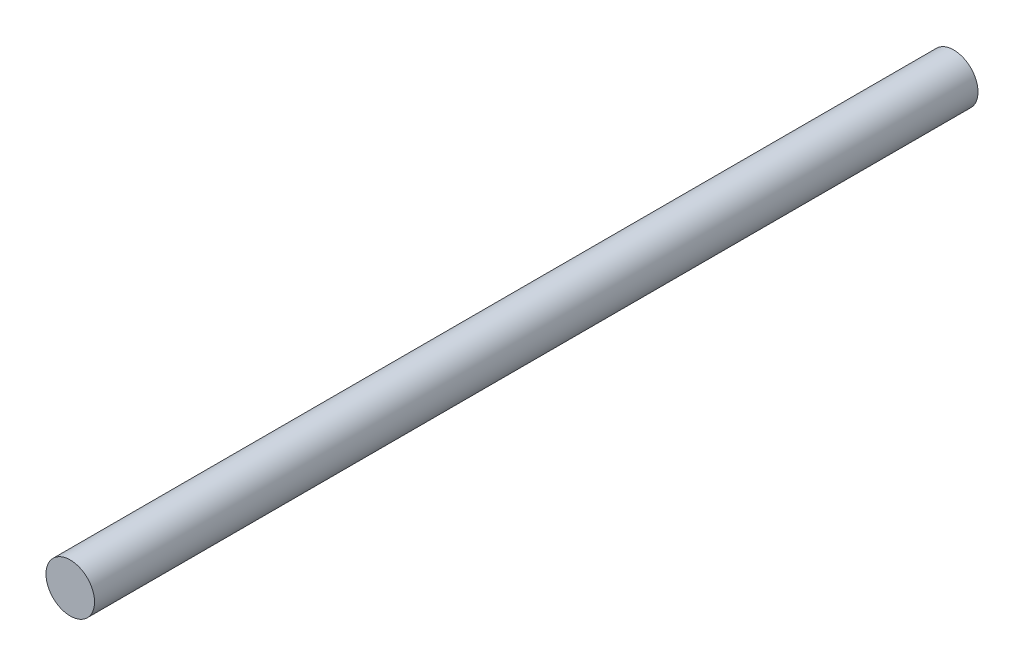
from build123d import *

# Parameters (mm, degrees)
SKETCH1_R      = 2.75
EXTRUDE1_DEPTH = 50


with BuildPart() as part:
    # Sketch1 → Extrude1 (new, symmetric)
    with BuildSketch(Plane.XY):
        Circle(SKETCH1_R)
    extrude(amount=EXTRUDE1_DEPTH, both=True)


solid = part.part
